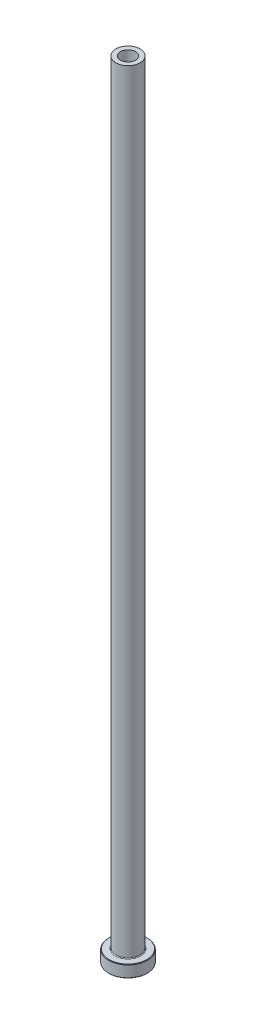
from build123d import *

# Parameters (mm, degrees)
FILLET1_R     = 0.3
CHAMFER1_SIZE = 0.2
CHAMFER3_SIZE = 0.5


with BuildPart() as part:
    # Sketch1 → Revolve1 (revolve)
    with BuildSketch(Plane.XY, mode=Mode.PRIVATE) as revolve1_sk:
        Polygon((-3.1, 325), (-5, 325), (-5, 5), (-8, 5), (-8, 0), (-3.35, 0), (-3.35, 268), (-3.1, 280), align=None)
    revolve(revolve1_sk.sketch.rotate(Axis((0, 92.187680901, 0), (0, -1, 0)), 270), axis=Axis((0, 92.187680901, 0), (0, -1, 0)))

    # Fillet1
    fillet1_edges = [part.edges().sort_by_distance(p)[0] for p in [
        (0, 5, -5),
    ]]
    fillet(fillet1_edges, radius=FILLET1_R)

    # Chamfer1
    chamfer1_edges = [part.edges().sort_by_distance(p)[0] for p in [
        (0, 0, -8),
        (0, 5, -8),
    ]]
    chamfer(chamfer1_edges, length=CHAMFER1_SIZE)

    # Chamfer3
    chamfer3_edges = [part.edges().sort_by_distance(p)[0] for p in [
        (0, 0, -3.35),
    ]]
    chamfer(chamfer3_edges, length=CHAMFER3_SIZE)


solid = part.part
